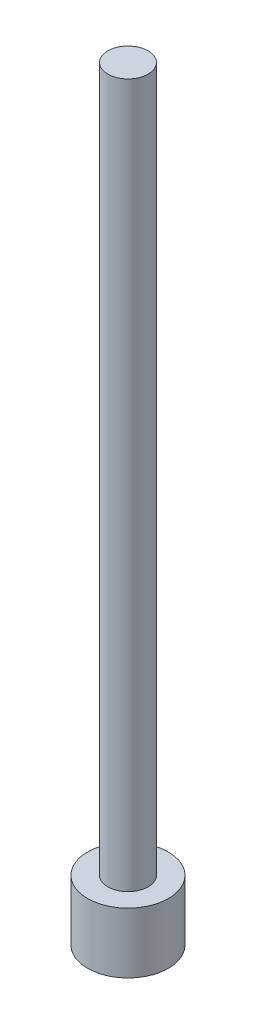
ISO-10303-21;
HEADER;
FILE_DESCRIPTION(('STEP AP214'),'2;1');
FILE_NAME('part.step','',(''),(''),'','','');
FILE_SCHEMA(('AUTOMOTIVE_DESIGN { 1 0 10303 214 1 1 1 1 }'));
ENDSEC;
DATA;
#1=APPLICATION_CONTEXT('core data for automotive mechanical design processes');
#2=APPLICATION_PROTOCOL_DEFINITION('international standard','automotive_design',2000,#1);
#3=PRODUCT_CONTEXT('',#1,'mechanical');
#4=PRODUCT('Part','Part','',(#3));
#5=PRODUCT_RELATED_PRODUCT_CATEGORY('part','',(#4));
#6=PRODUCT_DEFINITION_FORMATION('','',#4);
#7=PRODUCT_DEFINITION_CONTEXT('part definition',#1,'design');
#8=PRODUCT_DEFINITION('design','',#6,#7);
#9=PRODUCT_DEFINITION_SHAPE('','',#8);
#10=(LENGTH_UNIT() NAMED_UNIT(*) SI_UNIT(.MILLI.,.METRE.));
#11=(NAMED_UNIT(*) PLANE_ANGLE_UNIT() SI_UNIT($,.RADIAN.));
#12=(NAMED_UNIT(*) SI_UNIT($,.STERADIAN.) SOLID_ANGLE_UNIT());
#13=UNCERTAINTY_MEASURE_WITH_UNIT(LENGTH_MEASURE(1.E-05),#10,'distance_accuracy_value','');
#14=(GEOMETRIC_REPRESENTATION_CONTEXT(3) GLOBAL_UNCERTAINTY_ASSIGNED_CONTEXT((#13)) GLOBAL_UNIT_ASSIGNED_CONTEXT((#10,
#11,#12)) REPRESENTATION_CONTEXT('',''));
#15=CARTESIAN_POINT('',(0.,0.,0.));
#16=DIRECTION('',(0.,0.,1.));
#17=DIRECTION('',(1.,0.,0.));
#18=AXIS2_PLACEMENT_3D('',#15,#16,#17);
#19=CARTESIAN_POINT('',(0.,3.,0.));
#20=DIRECTION('',(0.,1.,0.));
#21=DIRECTION('',(0.,0.,1.));
#22=AXIS2_PLACEMENT_3D('',#19,#20,#21);
#23=PLANE('',#22);
#24=CARTESIAN_POINT('',(0.,3.,0.));
#25=DIRECTION('',(0.,1.,0.));
#26=DIRECTION('',(0.,0.,1.));
#27=AXIS2_PLACEMENT_3D('',#24,#25,#26);
#28=CIRCLE('',#27,2.);
#29=CARTESIAN_POINT('',(0.,3.,2.));
#30=VERTEX_POINT('',#29);
#31=EDGE_CURVE('E10',#30,#30,#28,.T.);
#32=ORIENTED_EDGE('',*,*,#31,.T.);
#33=EDGE_LOOP('',(#32));
#34=FACE_BOUND('',#33,.T.);
#35=CARTESIAN_POINT('',(0.,3.,0.));
#36=DIRECTION('',(0.,1.,0.));
#37=DIRECTION('',(0.,0.,1.));
#38=AXIS2_PLACEMENT_3D('',#35,#36,#37);
#39=CIRCLE('',#38,1.);
#40=CARTESIAN_POINT('',(0.,3.,1.));
#41=VERTEX_POINT('',#40);
#42=EDGE_CURVE('E45',#41,#41,#39,.T.);
#43=ORIENTED_EDGE('',*,*,#42,.F.);
#44=EDGE_LOOP('',(#43));
#45=FACE_BOUND('',#44,.T.);
#46=ADVANCED_FACE('F30',(#34,#45),#23,.T.);
#47=CARTESIAN_POINT('',(0.,3.,0.));
#48=DIRECTION('',(0.,-1.,0.));
#49=DIRECTION('',(0.,0.,-1.));
#50=AXIS2_PLACEMENT_3D('',#47,#48,#49);
#51=CYLINDRICAL_SURFACE('',#50,2.);
#52=ORIENTED_EDGE('',*,*,#31,.F.);
#53=EDGE_LOOP('',(#52));
#54=FACE_BOUND('',#53,.T.);
#55=CARTESIAN_POINT('',(0.,0.,0.));
#56=DIRECTION('',(0.,1.,0.));
#57=DIRECTION('',(0.,0.,1.));
#58=AXIS2_PLACEMENT_3D('',#55,#56,#57);
#59=CIRCLE('',#58,2.);
#60=CARTESIAN_POINT('',(0.,0.,2.));
#61=VERTEX_POINT('',#60);
#62=EDGE_CURVE('E37',#61,#61,#59,.T.);
#63=ORIENTED_EDGE('',*,*,#62,.T.);
#64=EDGE_LOOP('',(#63));
#65=FACE_BOUND('',#64,.T.);
#66=ADVANCED_FACE('F32',(#54,#65),#51,.T.);
#67=CARTESIAN_POINT('',(0.,0.,0.));
#68=DIRECTION('',(0.,1.,0.));
#69=DIRECTION('',(0.,0.,1.));
#70=AXIS2_PLACEMENT_3D('',#67,#68,#69);
#71=PLANE('',#70);
#72=ORIENTED_EDGE('',*,*,#62,.F.);
#73=EDGE_LOOP('',(#72));
#74=FACE_BOUND('',#73,.T.);
#75=ADVANCED_FACE('F57',(#74),#71,.F.);
#76=CARTESIAN_POINT('',(0.,37.9,0.));
#77=DIRECTION('',(0.,-1.,0.));
#78=DIRECTION('',(0.,0.,-1.));
#79=AXIS2_PLACEMENT_3D('',#76,#77,#78);
#80=CYLINDRICAL_SURFACE('',#79,1.);
#81=CARTESIAN_POINT('',(0.,37.9,0.));
#82=DIRECTION('',(0.,1.,0.));
#83=DIRECTION('',(0.,0.,1.));
#84=AXIS2_PLACEMENT_3D('',#81,#82,#83);
#85=CIRCLE('',#84,1.);
#86=CARTESIAN_POINT('',(0.,37.9,1.));
#87=VERTEX_POINT('',#86);
#88=EDGE_CURVE('E41',#87,#87,#85,.T.);
#89=ORIENTED_EDGE('',*,*,#88,.F.);
#90=EDGE_LOOP('',(#89));
#91=FACE_BOUND('',#90,.T.);
#92=ORIENTED_EDGE('',*,*,#42,.T.);
#93=EDGE_LOOP('',(#92));
#94=FACE_BOUND('',#93,.T.);
#95=ADVANCED_FACE('F51',(#91,#94),#80,.T.);
#96=CARTESIAN_POINT('',(0.,37.9,0.));
#97=DIRECTION('',(0.,1.,0.));
#98=DIRECTION('',(0.,0.,1.));
#99=AXIS2_PLACEMENT_3D('',#96,#97,#98);
#100=PLANE('',#99);
#101=ORIENTED_EDGE('',*,*,#88,.T.);
#102=EDGE_LOOP('',(#101));
#103=FACE_BOUND('',#102,.T.);
#104=ADVANCED_FACE('F65',(#103),#100,.T.);
#105=CLOSED_SHELL('',(#46,#66,#75,#95,#104));
#106=MANIFOLD_SOLID_BREP('B2',#105);
#107=ADVANCED_BREP_SHAPE_REPRESENTATION('',(#18,#106),#14);
#108=SHAPE_DEFINITION_REPRESENTATION(#9,#107);
ENDSEC;
END-ISO-10303-21;
